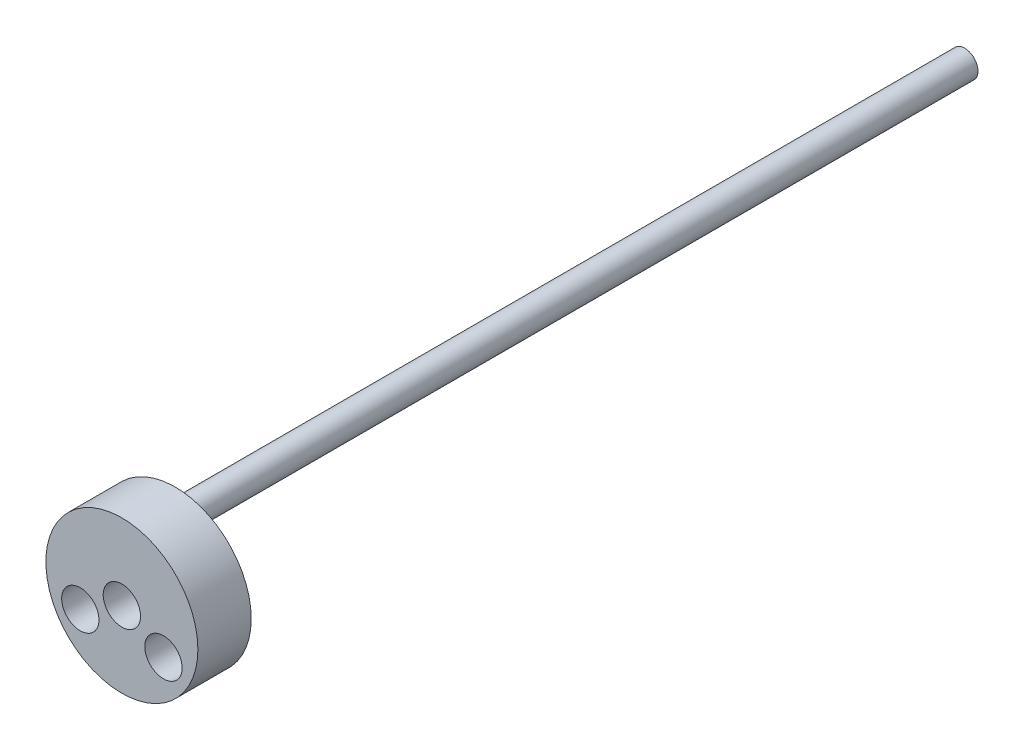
ISO-10303-21;
HEADER;
FILE_DESCRIPTION(('STEP AP214'),'2;1');
FILE_NAME('part.step','',(''),(''),'','','');
FILE_SCHEMA(('AUTOMOTIVE_DESIGN { 1 0 10303 214 1 1 1 1 }'));
ENDSEC;
DATA;
#1=APPLICATION_CONTEXT('core data for automotive mechanical design processes');
#2=APPLICATION_PROTOCOL_DEFINITION('international standard','automotive_design',2000,#1);
#3=PRODUCT_CONTEXT('',#1,'mechanical');
#4=PRODUCT('Part','Part','',(#3));
#5=PRODUCT_RELATED_PRODUCT_CATEGORY('part','',(#4));
#6=PRODUCT_DEFINITION_FORMATION('','',#4);
#7=PRODUCT_DEFINITION_CONTEXT('part definition',#1,'design');
#8=PRODUCT_DEFINITION('design','',#6,#7);
#9=PRODUCT_DEFINITION_SHAPE('','',#8);
#10=(LENGTH_UNIT() NAMED_UNIT(*) SI_UNIT(.MILLI.,.METRE.));
#11=(NAMED_UNIT(*) PLANE_ANGLE_UNIT() SI_UNIT($,.RADIAN.));
#12=(NAMED_UNIT(*) SI_UNIT($,.STERADIAN.) SOLID_ANGLE_UNIT());
#13=UNCERTAINTY_MEASURE_WITH_UNIT(LENGTH_MEASURE(1.E-05),#10,'distance_accuracy_value','');
#14=(GEOMETRIC_REPRESENTATION_CONTEXT(3) GLOBAL_UNCERTAINTY_ASSIGNED_CONTEXT((#13)) GLOBAL_UNIT_ASSIGNED_CONTEXT((#10,
#11,#12)) REPRESENTATION_CONTEXT('',''));
#15=CARTESIAN_POINT('',(0.,0.,0.));
#16=DIRECTION('',(0.,0.,1.));
#17=DIRECTION('',(1.,0.,0.));
#18=AXIS2_PLACEMENT_3D('',#15,#16,#17);
#19=CARTESIAN_POINT('',(0.,9.,2.));
#20=DIRECTION('',(0.,0.,1.));
#21=DIRECTION('',(1.,0.,0.));
#22=AXIS2_PLACEMENT_3D('',#19,#20,#21);
#23=PLANE('',#22);
#24=CARTESIAN_POINT('',(0.,9.,2.));
#25=DIRECTION('',(0.,0.,1.));
#26=DIRECTION('',(1.,0.,0.));
#27=AXIS2_PLACEMENT_3D('',#24,#25,#26);
#28=CIRCLE('',#27,3.5);
#29=CARTESIAN_POINT('',(3.5,9.,2.));
#30=VERTEX_POINT('',#29);
#31=EDGE_CURVE('E65',#30,#30,#28,.T.);
#32=ORIENTED_EDGE('',*,*,#31,.F.);
#33=EDGE_LOOP('',(#32));
#34=FACE_BOUND('',#33,.T.);
#35=CARTESIAN_POINT('',(0.,9.,2.));
#36=DIRECTION('',(0.,0.,1.));
#37=DIRECTION('',(1.,0.,0.));
#38=AXIS2_PLACEMENT_3D('',#35,#36,#37);
#39=CIRCLE('',#38,2.5);
#40=CARTESIAN_POINT('',(2.5,9.,2.));
#41=VERTEX_POINT('',#40);
#42=EDGE_CURVE('E10',#41,#41,#39,.F.);
#43=ORIENTED_EDGE('',*,*,#42,.F.);
#44=EDGE_LOOP('',(#43));
#45=FACE_BOUND('',#44,.T.);
#46=ADVANCED_FACE('F27',(#34,#45),#23,.F.);
#47=CARTESIAN_POINT('',(0.,9.,10.));
#48=DIRECTION('',(0.,0.,-1.));
#49=DIRECTION('',(-1.,0.,0.));
#50=AXIS2_PLACEMENT_3D('',#47,#48,#49);
#51=CYLINDRICAL_SURFACE('',#50,3.5);
#52=CARTESIAN_POINT('',(0.,9.,0.));
#53=DIRECTION('',(0.,0.,1.));
#54=DIRECTION('',(1.,0.,0.));
#55=AXIS2_PLACEMENT_3D('',#52,#53,#54);
#56=CIRCLE('',#55,3.5);
#57=CARTESIAN_POINT('',(3.5,9.,0.));
#58=VERTEX_POINT('',#57);
#59=EDGE_CURVE('E42',#58,#58,#56,.T.);
#60=ORIENTED_EDGE('',*,*,#59,.F.);
#61=EDGE_LOOP('',(#60));
#62=FACE_BOUND('',#61,.T.);
#63=ORIENTED_EDGE('',*,*,#31,.T.);
#64=EDGE_LOOP('',(#63));
#65=FACE_BOUND('',#64,.T.);
#66=ADVANCED_FACE('F88',(#62,#65),#51,.F.);
#67=CARTESIAN_POINT('',(0.,0.,10.));
#68=DIRECTION('',(0.,0.,1.));
#69=DIRECTION('',(1.,0.,0.));
#70=AXIS2_PLACEMENT_3D('',#67,#68,#69);
#71=PLANE('',#70);
#72=CARTESIAN_POINT('',(7.79422863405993,-4.50000000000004,10.));
#73=DIRECTION('',(0.,0.,1.));
#74=DIRECTION('',(1.,0.,0.));
#75=AXIS2_PLACEMENT_3D('',#72,#73,#74);
#76=CIRCLE('',#75,3.5);
#77=CARTESIAN_POINT('',(11.2942286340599,-4.50000000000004,10.));
#78=VERTEX_POINT('',#77);
#79=EDGE_CURVE('E53',#78,#78,#76,.T.);
#80=ORIENTED_EDGE('',*,*,#79,.F.);
#81=EDGE_LOOP('',(#80));
#82=FACE_BOUND('',#81,.T.);
#83=CARTESIAN_POINT('',(0.,0.,10.));
#84=DIRECTION('',(0.,0.,1.));
#85=DIRECTION('',(1.,0.,0.));
#86=AXIS2_PLACEMENT_3D('',#83,#84,#85);
#87=CIRCLE('',#86,14.25);
#88=CARTESIAN_POINT('',(14.25,0.,10.));
#89=VERTEX_POINT('',#88);
#90=EDGE_CURVE('E34',#89,#89,#87,.T.);
#91=ORIENTED_EDGE('',*,*,#90,.T.);
#92=EDGE_LOOP('',(#91));
#93=FACE_BOUND('',#92,.T.);
#94=CARTESIAN_POINT('',(0.,0.,10.));
#95=DIRECTION('',(0.,0.,1.));
#96=DIRECTION('',(1.,0.,0.));
#97=AXIS2_PLACEMENT_3D('',#94,#95,#96);
#98=CIRCLE('',#97,3.5);
#99=CARTESIAN_POINT('',(3.5,0.,10.));
#100=VERTEX_POINT('',#99);
#101=EDGE_CURVE('E47',#100,#100,#98,.T.);
#102=ORIENTED_EDGE('',*,*,#101,.F.);
#103=EDGE_LOOP('',(#102));
#104=FACE_BOUND('',#103,.T.);
#105=CARTESIAN_POINT('',(-7.79422863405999,-4.49999999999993,10.));
#106=DIRECTION('',(0.,0.,1.));
#107=DIRECTION('',(1.,0.,0.));
#108=AXIS2_PLACEMENT_3D('',#105,#106,#107);
#109=CIRCLE('',#108,3.5);
#110=CARTESIAN_POINT('',(-4.29422863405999,-4.49999999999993,10.));
#111=VERTEX_POINT('',#110);
#112=EDGE_CURVE('E59',#111,#111,#109,.T.);
#113=ORIENTED_EDGE('',*,*,#112,.F.);
#114=EDGE_LOOP('',(#113));
#115=FACE_BOUND('',#114,.T.);
#116=ADVANCED_FACE('F93',(#82,#93,#104,#115),#71,.T.);
#117=CARTESIAN_POINT('',(0.,0.,0.));
#118=DIRECTION('',(0.,0.,1.));
#119=DIRECTION('',(1.,0.,0.));
#120=AXIS2_PLACEMENT_3D('',#117,#118,#119);
#121=PLANE('',#120);
#122=CARTESIAN_POINT('',(7.79422863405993,-4.50000000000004,0.));
#123=DIRECTION('',(0.,0.,1.));
#124=DIRECTION('',(1.,0.,0.));
#125=AXIS2_PLACEMENT_3D('',#122,#123,#124);
#126=CIRCLE('',#125,3.5);
#127=CARTESIAN_POINT('',(11.2942286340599,-4.50000000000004,0.));
#128=VERTEX_POINT('',#127);
#129=EDGE_CURVE('E56',#128,#128,#126,.T.);
#130=ORIENTED_EDGE('',*,*,#129,.T.);
#131=EDGE_LOOP('',(#130));
#132=FACE_BOUND('',#131,.T.);
#133=ORIENTED_EDGE('',*,*,#59,.T.);
#134=EDGE_LOOP('',(#133));
#135=FACE_BOUND('',#134,.T.);
#136=CARTESIAN_POINT('',(0.,0.,0.));
#137=DIRECTION('',(0.,0.,1.));
#138=DIRECTION('',(1.,0.,0.));
#139=AXIS2_PLACEMENT_3D('',#136,#137,#138);
#140=CIRCLE('',#139,14.25);
#141=CARTESIAN_POINT('',(14.25,0.,0.));
#142=VERTEX_POINT('',#141);
#143=EDGE_CURVE('E38',#142,#142,#140,.T.);
#144=ORIENTED_EDGE('',*,*,#143,.F.);
#145=EDGE_LOOP('',(#144));
#146=FACE_BOUND('',#145,.T.);
#147=CARTESIAN_POINT('',(0.,0.,0.));
#148=DIRECTION('',(0.,0.,1.));
#149=DIRECTION('',(1.,0.,0.));
#150=AXIS2_PLACEMENT_3D('',#147,#148,#149);
#151=CIRCLE('',#150,3.5);
#152=CARTESIAN_POINT('',(3.5,0.,0.));
#153=VERTEX_POINT('',#152);
#154=EDGE_CURVE('E50',#153,#153,#151,.T.);
#155=ORIENTED_EDGE('',*,*,#154,.T.);
#156=EDGE_LOOP('',(#155));
#157=FACE_BOUND('',#156,.T.);
#158=CARTESIAN_POINT('',(-7.79422863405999,-4.49999999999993,0.));
#159=DIRECTION('',(0.,0.,1.));
#160=DIRECTION('',(1.,0.,0.));
#161=AXIS2_PLACEMENT_3D('',#158,#159,#160);
#162=CIRCLE('',#161,3.5);
#163=CARTESIAN_POINT('',(-4.29422863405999,-4.49999999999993,0.));
#164=VERTEX_POINT('',#163);
#165=EDGE_CURVE('E62',#164,#164,#162,.T.);
#166=ORIENTED_EDGE('',*,*,#165,.T.);
#167=EDGE_LOOP('',(#166));
#168=FACE_BOUND('',#167,.T.);
#169=ADVANCED_FACE('F106',(#132,#135,#146,#157,#168),#121,.F.);
#170=CARTESIAN_POINT('',(0.,0.,10.));
#171=DIRECTION('',(0.,0.,-1.));
#172=DIRECTION('',(-1.,0.,0.));
#173=AXIS2_PLACEMENT_3D('',#170,#171,#172);
#174=CYLINDRICAL_SURFACE('',#173,14.25);
#175=ORIENTED_EDGE('',*,*,#90,.F.);
#176=EDGE_LOOP('',(#175));
#177=FACE_BOUND('',#176,.T.);
#178=ORIENTED_EDGE('',*,*,#143,.T.);
#179=EDGE_LOOP('',(#178));
#180=FACE_BOUND('',#179,.T.);
#181=ADVANCED_FACE('F29',(#177,#180),#174,.T.);
#182=CARTESIAN_POINT('',(0.,0.,10.));
#183=DIRECTION('',(0.,0.,-1.));
#184=DIRECTION('',(-1.,0.,0.));
#185=AXIS2_PLACEMENT_3D('',#182,#183,#184);
#186=CYLINDRICAL_SURFACE('',#185,3.5);
#187=ORIENTED_EDGE('',*,*,#101,.T.);
#188=EDGE_LOOP('',(#187));
#189=FACE_BOUND('',#188,.T.);
#190=ORIENTED_EDGE('',*,*,#154,.F.);
#191=EDGE_LOOP('',(#190));
#192=FACE_BOUND('',#191,.T.);
#193=ADVANCED_FACE('F101',(#189,#192),#186,.F.);
#194=CARTESIAN_POINT('',(7.79422863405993,-4.50000000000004,10.));
#195=DIRECTION('',(0.,0.,-1.));
#196=DIRECTION('',(-1.,0.,0.));
#197=AXIS2_PLACEMENT_3D('',#194,#195,#196);
#198=CYLINDRICAL_SURFACE('',#197,3.5);
#199=ORIENTED_EDGE('',*,*,#79,.T.);
#200=EDGE_LOOP('',(#199));
#201=FACE_BOUND('',#200,.T.);
#202=ORIENTED_EDGE('',*,*,#129,.F.);
#203=EDGE_LOOP('',(#202));
#204=FACE_BOUND('',#203,.T.);
#205=ADVANCED_FACE('F83',(#201,#204),#198,.F.);
#206=CARTESIAN_POINT('',(-7.79422863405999,-4.49999999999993,10.));
#207=DIRECTION('',(0.,0.,-1.));
#208=DIRECTION('',(-1.,0.,0.));
#209=AXIS2_PLACEMENT_3D('',#206,#207,#208);
#210=CYLINDRICAL_SURFACE('',#209,3.5);
#211=ORIENTED_EDGE('',*,*,#112,.T.);
#212=EDGE_LOOP('',(#211));
#213=FACE_BOUND('',#212,.T.);
#214=ORIENTED_EDGE('',*,*,#165,.F.);
#215=EDGE_LOOP('',(#214));
#216=FACE_BOUND('',#215,.T.);
#217=ADVANCED_FACE('F76',(#213,#216),#210,.F.);
#218=CARTESIAN_POINT('',(0.,9.,-148.));
#219=DIRECTION('',(0.,0.,1.));
#220=DIRECTION('',(1.,0.,0.));
#221=AXIS2_PLACEMENT_3D('',#218,#219,#220);
#222=CYLINDRICAL_SURFACE('',#221,2.5);
#223=CARTESIAN_POINT('',(0.,9.,-148.));
#224=DIRECTION('',(0.,0.,-1.));
#225=DIRECTION('',(-1.,0.,0.));
#226=AXIS2_PLACEMENT_3D('',#223,#224,#225);
#227=CIRCLE('',#226,2.5);
#228=CARTESIAN_POINT('',(-2.5,9.,-148.));
#229=VERTEX_POINT('',#228);
#230=EDGE_CURVE('E68',#229,#229,#227,.T.);
#231=ORIENTED_EDGE('',*,*,#230,.F.);
#232=EDGE_LOOP('',(#231));
#233=FACE_BOUND('',#232,.T.);
#234=ORIENTED_EDGE('',*,*,#42,.T.);
#235=EDGE_LOOP('',(#234));
#236=FACE_BOUND('',#235,.T.);
#237=ADVANCED_FACE('F74',(#233,#236),#222,.T.);
#238=CARTESIAN_POINT('',(0.,9.,-148.));
#239=DIRECTION('',(0.,0.,-1.));
#240=DIRECTION('',(-1.,0.,0.));
#241=AXIS2_PLACEMENT_3D('',#238,#239,#240);
#242=PLANE('',#241);
#243=ORIENTED_EDGE('',*,*,#230,.T.);
#244=EDGE_LOOP('',(#243));
#245=FACE_BOUND('',#244,.T.);
#246=ADVANCED_FACE('F72',(#245),#242,.T.);
#247=CLOSED_SHELL('',(#46,#66,#116,#169,#181,#193,#205,#217,#237,#246));
#248=MANIFOLD_SOLID_BREP('B2',#247);
#249=ADVANCED_BREP_SHAPE_REPRESENTATION('',(#18,#248),#14);
#250=SHAPE_DEFINITION_REPRESENTATION(#9,#249);
ENDSEC;
END-ISO-10303-21;
